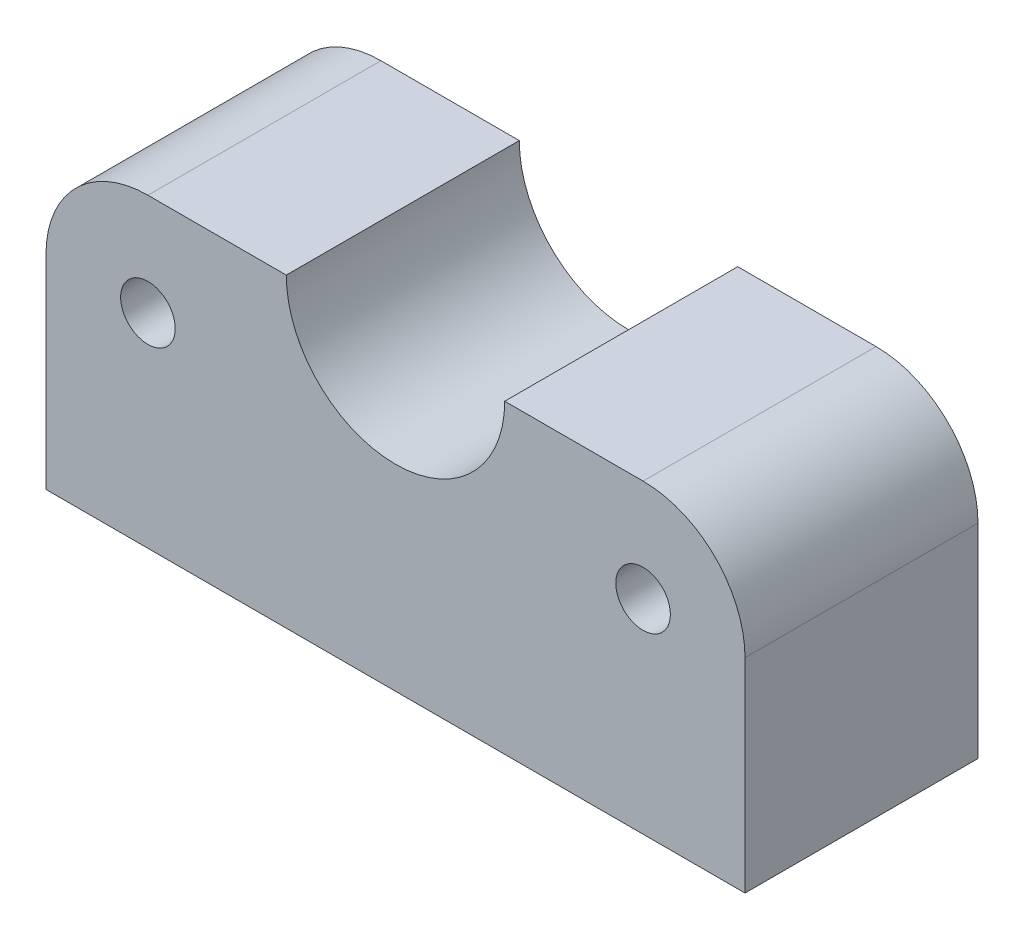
ISO-10303-21;
HEADER;
FILE_DESCRIPTION(('STEP AP214'),'2;1');
FILE_NAME('part.step','',(''),(''),'','','');
FILE_SCHEMA(('AUTOMOTIVE_DESIGN { 1 0 10303 214 1 1 1 1 }'));
ENDSEC;
DATA;
#1=APPLICATION_CONTEXT('core data for automotive mechanical design processes');
#2=APPLICATION_PROTOCOL_DEFINITION('international standard','automotive_design',2000,#1);
#3=PRODUCT_CONTEXT('',#1,'mechanical');
#4=PRODUCT('Part','Part','',(#3));
#5=PRODUCT_RELATED_PRODUCT_CATEGORY('part','',(#4));
#6=PRODUCT_DEFINITION_FORMATION('','',#4);
#7=PRODUCT_DEFINITION_CONTEXT('part definition',#1,'design');
#8=PRODUCT_DEFINITION('design','',#6,#7);
#9=PRODUCT_DEFINITION_SHAPE('','',#8);
#10=(LENGTH_UNIT() NAMED_UNIT(*) SI_UNIT(.MILLI.,.METRE.));
#11=(NAMED_UNIT(*) PLANE_ANGLE_UNIT() SI_UNIT($,.RADIAN.));
#12=(NAMED_UNIT(*) SI_UNIT($,.STERADIAN.) SOLID_ANGLE_UNIT());
#13=UNCERTAINTY_MEASURE_WITH_UNIT(LENGTH_MEASURE(1.E-05),#10,'distance_accuracy_value','');
#14=(GEOMETRIC_REPRESENTATION_CONTEXT(3) GLOBAL_UNCERTAINTY_ASSIGNED_CONTEXT((#13)) GLOBAL_UNIT_ASSIGNED_CONTEXT((#10,
#11,#12)) REPRESENTATION_CONTEXT('',''));
#15=CARTESIAN_POINT('',(0.,0.,0.));
#16=DIRECTION('',(0.,0.,1.));
#17=DIRECTION('',(1.,0.,0.));
#18=AXIS2_PLACEMENT_3D('',#15,#16,#17);
#19=CARTESIAN_POINT('',(-101.6,0.,-33.8666666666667));
#20=DIRECTION('',(0.,-1.,0.));
#21=DIRECTION('',(0.,0.,-1.));
#22=AXIS2_PLACEMENT_3D('',#19,#20,#21);
#23=PLANE('',#22);
#24=DIRECTION('',(1.,0.,0.));
#25=VECTOR('',#24,1.);
#26=CARTESIAN_POINT('',(-101.6,0.,0.));
#27=LINE('',#26,#25);
#28=CARTESIAN_POINT('',(-101.6,0.,0.));
#29=VERTEX_POINT('',#28);
#30=CARTESIAN_POINT('',(0.,0.,0.));
#31=VERTEX_POINT('',#30);
#32=EDGE_CURVE('E132',#29,#31,#27,.T.);
#33=ORIENTED_EDGE('',*,*,#32,.F.);
#34=DIRECTION('',(0.,0.,1.));
#35=VECTOR('',#34,1.);
#36=CARTESIAN_POINT('',(-101.6,0.,-33.8666666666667));
#37=LINE('',#36,#35);
#38=CARTESIAN_POINT('',(-101.6,0.,-33.8666666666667));
#39=VERTEX_POINT('',#38);
#40=EDGE_CURVE('E11',#39,#29,#37,.T.);
#41=ORIENTED_EDGE('',*,*,#40,.F.);
#42=DIRECTION('',(1.,0.,0.));
#43=VECTOR('',#42,1.);
#44=CARTESIAN_POINT('',(-101.6,0.,-33.8666666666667));
#45=LINE('',#44,#43);
#46=CARTESIAN_POINT('',(0.,0.,-33.8666666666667));
#47=VERTEX_POINT('',#46);
#48=EDGE_CURVE('E153',#39,#47,#45,.T.);
#49=ORIENTED_EDGE('',*,*,#48,.T.);
#50=DIRECTION('',(0.,0.,1.));
#51=VECTOR('',#50,1.);
#52=CARTESIAN_POINT('',(0.,0.,-33.8666666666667));
#53=LINE('',#52,#51);
#54=EDGE_CURVE('E35',#47,#31,#53,.T.);
#55=ORIENTED_EDGE('',*,*,#54,.T.);
#56=EDGE_LOOP('',(#33,#41,#49,#55));
#57=FACE_BOUND('',#56,.T.);
#58=ADVANCED_FACE('F32',(#57),#23,.T.);
#59=CARTESIAN_POINT('',(-101.6,29.6333333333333,-33.8666666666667));
#60=DIRECTION('',(-1.,0.,0.));
#61=DIRECTION('',(0.,0.,1.));
#62=AXIS2_PLACEMENT_3D('',#59,#60,#61);
#63=PLANE('',#62);
#64=DIRECTION('',(0.,-1.,0.));
#65=VECTOR('',#64,1.);
#66=CARTESIAN_POINT('',(-101.6,29.6333333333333,0.));
#67=LINE('',#66,#65);
#68=CARTESIAN_POINT('',(-101.6,29.6333333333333,0.));
#69=VERTEX_POINT('',#68);
#70=EDGE_CURVE('E151',#69,#29,#67,.T.);
#71=ORIENTED_EDGE('',*,*,#70,.F.);
#72=DIRECTION('',(0.,0.,1.));
#73=VECTOR('',#72,1.);
#74=CARTESIAN_POINT('',(-101.6,29.6333333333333,-33.8666666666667));
#75=LINE('',#74,#73);
#76=CARTESIAN_POINT('',(-101.6,29.6333333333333,-33.8666666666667));
#77=VERTEX_POINT('',#76);
#78=EDGE_CURVE('E41',#77,#69,#75,.T.);
#79=ORIENTED_EDGE('',*,*,#78,.F.);
#80=DIRECTION('',(0.,-1.,0.));
#81=VECTOR('',#80,1.);
#82=CARTESIAN_POINT('',(-101.6,29.6333333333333,-33.8666666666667));
#83=LINE('',#82,#81);
#84=EDGE_CURVE('E122',#77,#39,#83,.T.);
#85=ORIENTED_EDGE('',*,*,#84,.T.);
#86=ORIENTED_EDGE('',*,*,#40,.T.);
#87=EDGE_LOOP('',(#71,#79,#85,#86));
#88=FACE_BOUND('',#87,.T.);
#89=ADVANCED_FACE('F165',(#88),#63,.T.);
#90=CARTESIAN_POINT('',(-86.7833333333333,29.6333333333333,-33.8666666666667));
#91=DIRECTION('',(0.,0.,1.));
#92=DIRECTION('',(1.,0.,0.));
#93=AXIS2_PLACEMENT_3D('',#90,#91,#92);
#94=CYLINDRICAL_SURFACE('',#93,14.8166666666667);
#95=CARTESIAN_POINT('',(-86.7833333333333,29.6333333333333,0.));
#96=DIRECTION('',(0.,0.,1.));
#97=DIRECTION('',(1.,0.,0.));
#98=AXIS2_PLACEMENT_3D('',#95,#96,#97);
#99=CIRCLE('',#98,14.8166666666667);
#100=CARTESIAN_POINT('',(-86.7833333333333,44.45,0.));
#101=VERTEX_POINT('',#100);
#102=EDGE_CURVE('E109',#101,#69,#99,.T.);
#103=ORIENTED_EDGE('',*,*,#102,.F.);
#104=DIRECTION('',(0.,0.,1.));
#105=VECTOR('',#104,1.);
#106=CARTESIAN_POINT('',(-86.7833333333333,44.45,-33.8666666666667));
#107=LINE('',#106,#105);
#108=CARTESIAN_POINT('',(-86.7833333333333,44.45,-33.8666666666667));
#109=VERTEX_POINT('',#108);
#110=EDGE_CURVE('E104',#109,#101,#107,.T.);
#111=ORIENTED_EDGE('',*,*,#110,.F.);
#112=CARTESIAN_POINT('',(-86.7833333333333,29.6333333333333,-33.8666666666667));
#113=DIRECTION('',(0.,0.,1.));
#114=DIRECTION('',(1.,0.,0.));
#115=AXIS2_PLACEMENT_3D('',#112,#113,#114);
#116=CIRCLE('',#115,14.8166666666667);
#117=EDGE_CURVE('E107',#109,#77,#116,.T.);
#118=ORIENTED_EDGE('',*,*,#117,.T.);
#119=ORIENTED_EDGE('',*,*,#78,.T.);
#120=EDGE_LOOP('',(#103,#111,#118,#119));
#121=FACE_BOUND('',#120,.T.);
#122=ADVANCED_FACE('F106',(#121),#94,.T.);
#123=CARTESIAN_POINT('',(-66.675,44.45,-33.8666666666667));
#124=DIRECTION('',(0.,1.,0.));
#125=DIRECTION('',(-1.,0.,0.));
#126=AXIS2_PLACEMENT_3D('',#123,#124,#125);
#127=PLANE('',#126);
#128=DIRECTION('',(-1.,0.,0.));
#129=VECTOR('',#128,1.);
#130=CARTESIAN_POINT('',(-66.675,44.45,0.));
#131=LINE('',#130,#129);
#132=CARTESIAN_POINT('',(-66.675,44.45,0.));
#133=VERTEX_POINT('',#132);
#134=EDGE_CURVE('E148',#133,#101,#131,.T.);
#135=ORIENTED_EDGE('',*,*,#134,.F.);
#136=DIRECTION('',(0.,0.,1.));
#137=VECTOR('',#136,1.);
#138=CARTESIAN_POINT('',(-66.675,44.45,-33.8666666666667));
#139=LINE('',#138,#137);
#140=CARTESIAN_POINT('',(-66.675,44.45,-33.8666666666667));
#141=VERTEX_POINT('',#140);
#142=EDGE_CURVE('E114',#141,#133,#139,.T.);
#143=ORIENTED_EDGE('',*,*,#142,.F.);
#144=DIRECTION('',(-1.,0.,0.));
#145=VECTOR('',#144,1.);
#146=CARTESIAN_POINT('',(-66.675,44.45,-33.8666666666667));
#147=LINE('',#146,#145);
#148=EDGE_CURVE('E120',#141,#109,#147,.T.);
#149=ORIENTED_EDGE('',*,*,#148,.T.);
#150=ORIENTED_EDGE('',*,*,#110,.T.);
#151=EDGE_LOOP('',(#135,#143,#149,#150));
#152=FACE_BOUND('',#151,.T.);
#153=ADVANCED_FACE('F124',(#152),#127,.T.);
#154=CARTESIAN_POINT('',(-50.8,44.45,-33.8666666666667));
#155=DIRECTION('',(0.,0.,1.));
#156=DIRECTION('',(1.,0.,0.));
#157=AXIS2_PLACEMENT_3D('',#154,#155,#156);
#158=CYLINDRICAL_SURFACE('',#157,15.875);
#159=CARTESIAN_POINT('',(-50.8,44.45,0.));
#160=DIRECTION('',(0.,0.,-1.));
#161=DIRECTION('',(1.,0.,0.));
#162=AXIS2_PLACEMENT_3D('',#159,#160,#161);
#163=CIRCLE('',#162,15.875);
#164=CARTESIAN_POINT('',(-34.925,44.45,0.));
#165=VERTEX_POINT('',#164);
#166=EDGE_CURVE('E145',#165,#133,#163,.T.);
#167=ORIENTED_EDGE('',*,*,#166,.F.);
#168=DIRECTION('',(0.,0.,1.));
#169=VECTOR('',#168,1.);
#170=CARTESIAN_POINT('',(-34.925,44.45,-33.8666666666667));
#171=LINE('',#170,#169);
#172=CARTESIAN_POINT('',(-34.925,44.45,-33.8666666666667));
#173=VERTEX_POINT('',#172);
#174=EDGE_CURVE('E157',#173,#165,#171,.T.);
#175=ORIENTED_EDGE('',*,*,#174,.F.);
#176=CARTESIAN_POINT('',(-50.8,44.45,-33.8666666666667));
#177=DIRECTION('',(0.,0.,-1.));
#178=DIRECTION('',(1.,0.,0.));
#179=AXIS2_PLACEMENT_3D('',#176,#177,#178);
#180=CIRCLE('',#179,15.875);
#181=EDGE_CURVE('E125',#173,#141,#180,.T.);
#182=ORIENTED_EDGE('',*,*,#181,.T.);
#183=ORIENTED_EDGE('',*,*,#142,.T.);
#184=EDGE_LOOP('',(#167,#175,#182,#183));
#185=FACE_BOUND('',#184,.T.);
#186=ADVANCED_FACE('F178',(#185),#158,.F.);
#187=CARTESIAN_POINT('',(-14.8166666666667,44.45,-33.8666666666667));
#188=DIRECTION('',(0.,1.,0.));
#189=DIRECTION('',(-1.,0.,0.));
#190=AXIS2_PLACEMENT_3D('',#187,#188,#189);
#191=PLANE('',#190);
#192=DIRECTION('',(-1.,0.,0.));
#193=VECTOR('',#192,1.);
#194=CARTESIAN_POINT('',(-14.8166666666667,44.45,0.));
#195=LINE('',#194,#193);
#196=CARTESIAN_POINT('',(-14.8166666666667,44.45,0.));
#197=VERTEX_POINT('',#196);
#198=EDGE_CURVE('E142',#197,#165,#195,.T.);
#199=ORIENTED_EDGE('',*,*,#198,.F.);
#200=DIRECTION('',(0.,0.,1.));
#201=VECTOR('',#200,1.);
#202=CARTESIAN_POINT('',(-14.8166666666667,44.45,-33.8666666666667));
#203=LINE('',#202,#201);
#204=CARTESIAN_POINT('',(-14.8166666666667,44.45,-33.8666666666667));
#205=VERTEX_POINT('',#204);
#206=EDGE_CURVE('E159',#205,#197,#203,.T.);
#207=ORIENTED_EDGE('',*,*,#206,.F.);
#208=DIRECTION('',(-1.,0.,0.));
#209=VECTOR('',#208,1.);
#210=CARTESIAN_POINT('',(-14.8166666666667,44.45,-33.8666666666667));
#211=LINE('',#210,#209);
#212=EDGE_CURVE('E127',#205,#173,#211,.T.);
#213=ORIENTED_EDGE('',*,*,#212,.T.);
#214=ORIENTED_EDGE('',*,*,#174,.T.);
#215=EDGE_LOOP('',(#199,#207,#213,#214));
#216=FACE_BOUND('',#215,.T.);
#217=ADVANCED_FACE('F181',(#216),#191,.T.);
#218=CARTESIAN_POINT('',(-14.8166666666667,29.6333333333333,-33.8666666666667));
#219=DIRECTION('',(0.,0.,1.));
#220=DIRECTION('',(1.,0.,0.));
#221=AXIS2_PLACEMENT_3D('',#218,#219,#220);
#222=CYLINDRICAL_SURFACE('',#221,14.8166666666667);
#223=CARTESIAN_POINT('',(-14.8166666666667,29.6333333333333,0.));
#224=DIRECTION('',(0.,0.,1.));
#225=DIRECTION('',(1.,0.,0.));
#226=AXIS2_PLACEMENT_3D('',#223,#224,#225);
#227=CIRCLE('',#226,14.8166666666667);
#228=CARTESIAN_POINT('',(0.,29.6333333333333,0.));
#229=VERTEX_POINT('',#228);
#230=EDGE_CURVE('E139',#229,#197,#227,.T.);
#231=ORIENTED_EDGE('',*,*,#230,.F.);
#232=DIRECTION('',(0.,0.,1.));
#233=VECTOR('',#232,1.);
#234=CARTESIAN_POINT('',(0.,29.6333333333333,-33.8666666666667));
#235=LINE('',#234,#233);
#236=CARTESIAN_POINT('',(0.,29.6333333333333,-33.8666666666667));
#237=VERTEX_POINT('',#236);
#238=EDGE_CURVE('E160',#237,#229,#235,.T.);
#239=ORIENTED_EDGE('',*,*,#238,.F.);
#240=CARTESIAN_POINT('',(-14.8166666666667,29.6333333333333,-33.8666666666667));
#241=DIRECTION('',(0.,0.,1.));
#242=DIRECTION('',(1.,0.,0.));
#243=AXIS2_PLACEMENT_3D('',#240,#241,#242);
#244=CIRCLE('',#243,14.8166666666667);
#245=EDGE_CURVE('E234',#237,#205,#244,.T.);
#246=ORIENTED_EDGE('',*,*,#245,.T.);
#247=ORIENTED_EDGE('',*,*,#206,.T.);
#248=EDGE_LOOP('',(#231,#239,#246,#247));
#249=FACE_BOUND('',#248,.T.);
#250=ADVANCED_FACE('F185',(#249),#222,.T.);
#251=CARTESIAN_POINT('',(0.,0.,-33.8666666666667));
#252=DIRECTION('',(1.,0.,0.));
#253=DIRECTION('',(0.,0.,-1.));
#254=AXIS2_PLACEMENT_3D('',#251,#252,#253);
#255=PLANE('',#254);
#256=DIRECTION('',(0.,1.,0.));
#257=VECTOR('',#256,1.);
#258=CARTESIAN_POINT('',(0.,0.,0.));
#259=LINE('',#258,#257);
#260=EDGE_CURVE('E135',#31,#229,#259,.T.);
#261=ORIENTED_EDGE('',*,*,#260,.F.);
#262=ORIENTED_EDGE('',*,*,#54,.F.);
#263=DIRECTION('',(0.,1.,0.));
#264=VECTOR('',#263,1.);
#265=CARTESIAN_POINT('',(0.,0.,-33.8666666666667));
#266=LINE('',#265,#264);
#267=EDGE_CURVE('E232',#47,#237,#266,.T.);
#268=ORIENTED_EDGE('',*,*,#267,.T.);
#269=ORIENTED_EDGE('',*,*,#238,.T.);
#270=EDGE_LOOP('',(#261,#262,#268,#269));
#271=FACE_BOUND('',#270,.T.);
#272=ADVANCED_FACE('F162',(#271),#255,.T.);
#273=CARTESIAN_POINT('',(-14.8166666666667,29.6333333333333,-33.8666666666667));
#274=DIRECTION('',(0.,0.,1.));
#275=DIRECTION('',(1.,0.,0.));
#276=AXIS2_PLACEMENT_3D('',#273,#274,#275);
#277=PLANE('',#276);
#278=ORIENTED_EDGE('',*,*,#48,.F.);
#279=ORIENTED_EDGE('',*,*,#84,.F.);
#280=ORIENTED_EDGE('',*,*,#117,.F.);
#281=ORIENTED_EDGE('',*,*,#148,.F.);
#282=ORIENTED_EDGE('',*,*,#181,.F.);
#283=ORIENTED_EDGE('',*,*,#212,.F.);
#284=ORIENTED_EDGE('',*,*,#245,.F.);
#285=ORIENTED_EDGE('',*,*,#267,.F.);
#286=EDGE_LOOP('',(#278,#279,#280,#281,#282,#283,#284,#285));
#287=FACE_BOUND('',#286,.T.);
#288=ADVANCED_FACE('F118',(#287),#277,.F.);
#289=CARTESIAN_POINT('',(-14.8166666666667,29.6333333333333,0.));
#290=DIRECTION('',(0.,0.,1.));
#291=DIRECTION('',(1.,0.,0.));
#292=AXIS2_PLACEMENT_3D('',#289,#290,#291);
#293=PLANE('',#292);
#294=CARTESIAN_POINT('',(-86.7833333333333,29.6333333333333,0.));
#295=DIRECTION('',(0.,0.,1.));
#296=DIRECTION('',(1.,0.,0.));
#297=AXIS2_PLACEMENT_3D('',#294,#295,#296);
#298=CIRCLE('',#297,3.96874999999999);
#299=CARTESIAN_POINT('',(-82.8145833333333,29.6333333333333,0.));
#300=VERTEX_POINT('',#299);
#301=EDGE_CURVE('E221',#300,#300,#298,.T.);
#302=ORIENTED_EDGE('',*,*,#301,.F.);
#303=EDGE_LOOP('',(#302));
#304=FACE_BOUND('',#303,.T.);
#305=CARTESIAN_POINT('',(-14.8166666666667,29.6333333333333,0.));
#306=DIRECTION('',(0.,0.,1.));
#307=DIRECTION('',(1.,0.,0.));
#308=AXIS2_PLACEMENT_3D('',#305,#306,#307);
#309=CIRCLE('',#308,3.96874999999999);
#310=CARTESIAN_POINT('',(-10.8479166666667,29.6333333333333,0.));
#311=VERTEX_POINT('',#310);
#312=EDGE_CURVE('E136',#311,#311,#309,.T.);
#313=ORIENTED_EDGE('',*,*,#312,.F.);
#314=EDGE_LOOP('',(#313));
#315=FACE_BOUND('',#314,.T.);
#316=ORIENTED_EDGE('',*,*,#32,.T.);
#317=ORIENTED_EDGE('',*,*,#260,.T.);
#318=ORIENTED_EDGE('',*,*,#230,.T.);
#319=ORIENTED_EDGE('',*,*,#198,.T.);
#320=ORIENTED_EDGE('',*,*,#166,.T.);
#321=ORIENTED_EDGE('',*,*,#134,.T.);
#322=ORIENTED_EDGE('',*,*,#102,.T.);
#323=ORIENTED_EDGE('',*,*,#70,.T.);
#324=EDGE_LOOP('',(#316,#317,#318,#319,#320,#321,#322,#323));
#325=FACE_BOUND('',#324,.T.);
#326=ADVANCED_FACE('F164',(#304,#315,#325),#293,.T.);
#327=CARTESIAN_POINT('',(-14.8166666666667,29.6333333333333,0.));
#328=DIRECTION('',(0.,0.,1.));
#329=DIRECTION('',(1.,0.,0.));
#330=AXIS2_PLACEMENT_3D('',#327,#328,#329);
#331=CYLINDRICAL_SURFACE('',#330,3.96874999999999);
#332=CARTESIAN_POINT('',(-14.8166666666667,29.6333333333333,-23.8125));
#333=DIRECTION('',(0.,0.,1.));
#334=DIRECTION('',(1.,0.,0.));
#335=AXIS2_PLACEMENT_3D('',#332,#333,#334);
#336=CIRCLE('',#335,3.96874999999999);
#337=CARTESIAN_POINT('',(-10.8479166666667,29.6333333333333,-23.8125));
#338=VERTEX_POINT('',#337);
#339=EDGE_CURVE('E224',#338,#338,#336,.T.);
#340=ORIENTED_EDGE('',*,*,#339,.F.);
#341=EDGE_LOOP('',(#340));
#342=FACE_BOUND('',#341,.T.);
#343=ORIENTED_EDGE('',*,*,#312,.T.);
#344=EDGE_LOOP('',(#343));
#345=FACE_BOUND('',#344,.T.);
#346=ADVANCED_FACE('F196',(#342,#345),#331,.F.);
#347=CARTESIAN_POINT('',(-14.8166666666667,29.6333333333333,-23.8125));
#348=DIRECTION('',(0.,0.,1.));
#349=DIRECTION('',(1.,0.,0.));
#350=AXIS2_PLACEMENT_3D('',#347,#348,#349);
#351=CONICAL_SURFACE('',#350,3.96874999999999,1.02974425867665);
#352=CARTESIAN_POINT('',(-14.8166666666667,29.6333333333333,-26.1971655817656));
#353=VERTEX_POINT('',#352);
#354=VERTEX_LOOP('',#353);
#355=FACE_BOUND('',#354,.T.);
#356=ORIENTED_EDGE('',*,*,#339,.T.);
#357=EDGE_LOOP('',(#356));
#358=FACE_BOUND('',#357,.T.);
#359=ADVANCED_FACE('F201',(#355,#358),#351,.F.);
#360=CARTESIAN_POINT('',(-86.7833333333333,29.6333333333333,0.));
#361=DIRECTION('',(0.,0.,1.));
#362=DIRECTION('',(1.,0.,0.));
#363=AXIS2_PLACEMENT_3D('',#360,#361,#362);
#364=CYLINDRICAL_SURFACE('',#363,3.96874999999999);
#365=CARTESIAN_POINT('',(-86.7833333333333,29.6333333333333,-23.8125));
#366=DIRECTION('',(0.,0.,1.));
#367=DIRECTION('',(1.,0.,0.));
#368=AXIS2_PLACEMENT_3D('',#365,#366,#367);
#369=CIRCLE('',#368,3.96874999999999);
#370=CARTESIAN_POINT('',(-82.8145833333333,29.6333333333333,-23.8125));
#371=VERTEX_POINT('',#370);
#372=EDGE_CURVE('E220',#371,#371,#369,.T.);
#373=ORIENTED_EDGE('',*,*,#372,.F.);
#374=EDGE_LOOP('',(#373));
#375=FACE_BOUND('',#374,.T.);
#376=ORIENTED_EDGE('',*,*,#301,.T.);
#377=EDGE_LOOP('',(#376));
#378=FACE_BOUND('',#377,.T.);
#379=ADVANCED_FACE('F205',(#375,#378),#364,.F.);
#380=CARTESIAN_POINT('',(-86.7833333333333,29.6333333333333,-23.8125));
#381=DIRECTION('',(0.,0.,1.));
#382=DIRECTION('',(1.,0.,0.));
#383=AXIS2_PLACEMENT_3D('',#380,#381,#382);
#384=CONICAL_SURFACE('',#383,3.96874999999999,1.02974425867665);
#385=CARTESIAN_POINT('',(-86.7833333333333,29.6333333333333,-26.1971655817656));
#386=VERTEX_POINT('',#385);
#387=VERTEX_LOOP('',#386);
#388=FACE_BOUND('',#387,.T.);
#389=ORIENTED_EDGE('',*,*,#372,.T.);
#390=EDGE_LOOP('',(#389));
#391=FACE_BOUND('',#390,.T.);
#392=ADVANCED_FACE('F209',(#388,#391),#384,.F.);
#393=CLOSED_SHELL('',(#58,#89,#122,#153,#186,#217,#250,#272,#288,#326,#346,#359,#379,#392));
#394=MANIFOLD_SOLID_BREP('B2',#393);
#395=ADVANCED_BREP_SHAPE_REPRESENTATION('',(#18,#394),#14);
#396=SHAPE_DEFINITION_REPRESENTATION(#9,#395);
ENDSEC;
END-ISO-10303-21;
